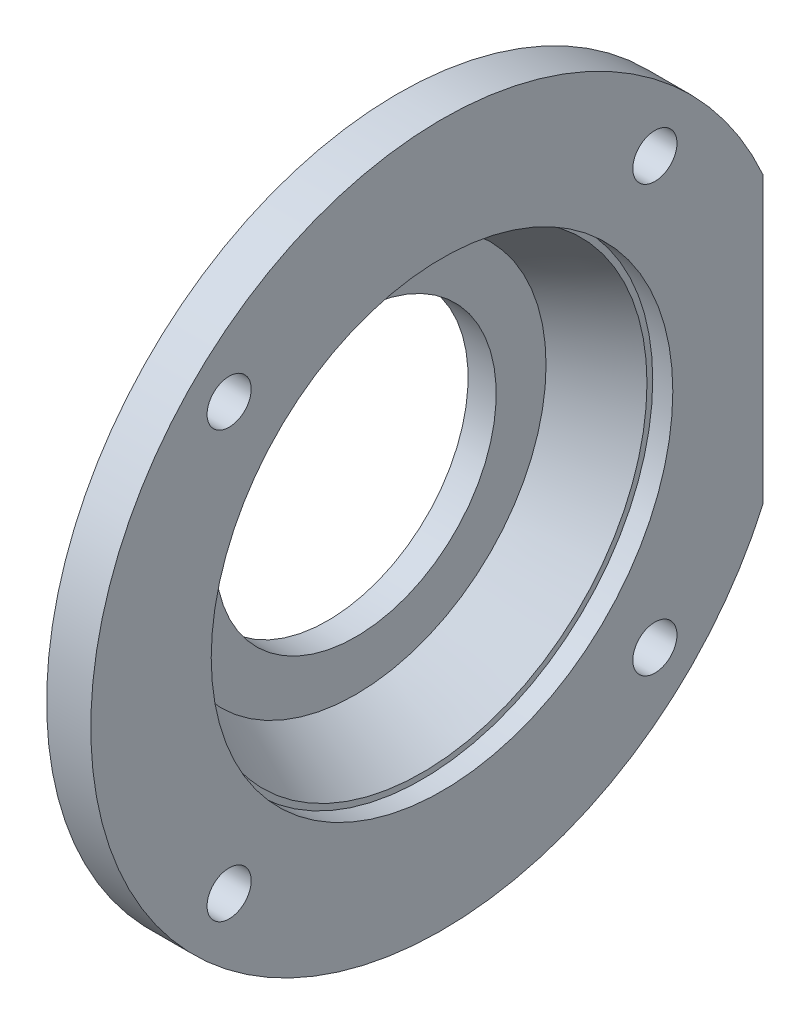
ISO-10303-21;
HEADER;
FILE_DESCRIPTION(('STEP AP214'),'2;1');
FILE_NAME('part.step','',(''),(''),'','','');
FILE_SCHEMA(('AUTOMOTIVE_DESIGN { 1 0 10303 214 1 1 1 1 }'));
ENDSEC;
DATA;
#1=APPLICATION_CONTEXT('core data for automotive mechanical design processes');
#2=APPLICATION_PROTOCOL_DEFINITION('international standard','automotive_design',2000,#1);
#3=PRODUCT_CONTEXT('',#1,'mechanical');
#4=PRODUCT('Part','Part','',(#3));
#5=PRODUCT_RELATED_PRODUCT_CATEGORY('part','',(#4));
#6=PRODUCT_DEFINITION_FORMATION('','',#4);
#7=PRODUCT_DEFINITION_CONTEXT('part definition',#1,'design');
#8=PRODUCT_DEFINITION('design','',#6,#7);
#9=PRODUCT_DEFINITION_SHAPE('','',#8);
#10=(LENGTH_UNIT() NAMED_UNIT(*) SI_UNIT(.MILLI.,.METRE.));
#11=(NAMED_UNIT(*) PLANE_ANGLE_UNIT() SI_UNIT($,.RADIAN.));
#12=(NAMED_UNIT(*) SI_UNIT($,.STERADIAN.) SOLID_ANGLE_UNIT());
#13=UNCERTAINTY_MEASURE_WITH_UNIT(LENGTH_MEASURE(1.E-05),#10,'distance_accuracy_value','');
#14=(GEOMETRIC_REPRESENTATION_CONTEXT(3) GLOBAL_UNCERTAINTY_ASSIGNED_CONTEXT((#13)) GLOBAL_UNIT_ASSIGNED_CONTEXT((#10,
#11,#12)) REPRESENTATION_CONTEXT('',''));
#15=CARTESIAN_POINT('',(0.,0.,0.));
#16=DIRECTION('',(0.,0.,1.));
#17=DIRECTION('',(1.,0.,0.));
#18=AXIS2_PLACEMENT_3D('',#15,#16,#17);
#19=CARTESIAN_POINT('',(57.5,116.13,41.87));
#20=DIRECTION('',(1.,0.,0.));
#21=DIRECTION('',(0.,1.,0.));
#22=AXIS2_PLACEMENT_3D('',#19,#20,#21);
#23=PLANE('',#22);
#24=CARTESIAN_POINT('',(57.5,63.,95.));
#25=DIRECTION('',(-1.,0.,0.));
#26=DIRECTION('',(0.,0.,1.));
#27=AXIS2_PLACEMENT_3D('',#24,#25,#26);
#28=CIRCLE('',#27,52.5);
#29=CARTESIAN_POINT('',(57.4999999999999,63.,147.5));
#30=VERTEX_POINT('',#29);
#31=EDGE_CURVE('E212',#30,#30,#28,.F.);
#32=ORIENTED_EDGE('',*,*,#31,.F.);
#33=EDGE_LOOP('',(#32));
#34=FACE_BOUND('',#33,.T.);
#35=CARTESIAN_POINT('',(57.5,63.,95.));
#36=DIRECTION('',(-1.,0.,0.));
#37=DIRECTION('',(0.,0.,1.));
#38=AXIS2_PLACEMENT_3D('',#35,#36,#37);
#39=CIRCLE('',#38,35.);
#40=CARTESIAN_POINT('',(57.5,63.,130.));
#41=VERTEX_POINT('',#40);
#42=EDGE_CURVE('E20',#41,#41,#39,.F.);
#43=ORIENTED_EDGE('',*,*,#42,.T.);
#44=EDGE_LOOP('',(#43));
#45=FACE_BOUND('',#44,.T.);
#46=ADVANCED_FACE('F16',(#34,#45),#23,.F.);
#47=CARTESIAN_POINT('',(64.5,63.,95.));
#48=DIRECTION('',(-1.,0.,0.));
#49=DIRECTION('',(0.,0.,1.));
#50=AXIS2_PLACEMENT_3D('',#47,#48,#49);
#51=CYLINDRICAL_SURFACE('',#50,35.);
#52=ORIENTED_EDGE('',*,*,#42,.F.);
#53=EDGE_LOOP('',(#52));
#54=FACE_BOUND('',#53,.T.);
#55=CARTESIAN_POINT('',(64.5,63.,95.));
#56=DIRECTION('',(-1.,0.,0.));
#57=DIRECTION('',(0.,0.,1.));
#58=AXIS2_PLACEMENT_3D('',#55,#56,#57);
#59=CIRCLE('',#58,35.);
#60=CARTESIAN_POINT('',(64.4999999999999,63.,130.));
#61=VERTEX_POINT('',#60);
#62=EDGE_CURVE('E209',#61,#61,#59,.F.);
#63=ORIENTED_EDGE('',*,*,#62,.T.);
#64=EDGE_LOOP('',(#63));
#65=FACE_BOUND('',#64,.T.);
#66=ADVANCED_FACE('F221',(#54,#65),#51,.F.);
#67=CARTESIAN_POINT('',(64.5,63.,95.));
#68=DIRECTION('',(-1.,0.,0.));
#69=DIRECTION('',(0.,0.,1.));
#70=AXIS2_PLACEMENT_3D('',#67,#68,#69);
#71=CYLINDRICAL_SURFACE('',#70,52.5);
#72=CARTESIAN_POINT('',(64.5,63.,95.));
#73=DIRECTION('',(1.,0.,0.));
#74=DIRECTION('',(0.,-1.,0.));
#75=AXIS2_PLACEMENT_3D('',#72,#73,#74);
#76=CIRCLE('',#75,52.5);
#77=CARTESIAN_POINT('',(64.5,10.5,95.));
#78=VERTEX_POINT('',#77);
#79=EDGE_CURVE('E208',#78,#78,#76,.T.);
#80=ORIENTED_EDGE('',*,*,#79,.F.);
#81=EDGE_LOOP('',(#80));
#82=FACE_BOUND('',#81,.T.);
#83=ORIENTED_EDGE('',*,*,#31,.T.);
#84=EDGE_LOOP('',(#83));
#85=FACE_BOUND('',#84,.T.);
#86=ADVANCED_FACE('F224',(#82,#85),#71,.T.);
#87=CARTESIAN_POINT('',(64.4999999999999,110.989067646,142.989067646));
#88=DIRECTION('',(-1.,0.,0.));
#89=DIRECTION('',(0.,0.,1.));
#90=AXIS2_PLACEMENT_3D('',#87,#88,#89);
#91=PLANE('',#90);
#92=CARTESIAN_POINT('',(64.4999999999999,63.,95.));
#93=DIRECTION('',(1.,0.,0.));
#94=DIRECTION('',(0.,0.,-1.));
#95=AXIS2_PLACEMENT_3D('',#92,#93,#94);
#96=CIRCLE('',#95,47.420027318);
#97=CARTESIAN_POINT('',(64.5,63.,47.579972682));
#98=VERTEX_POINT('',#97);
#99=EDGE_CURVE('E72',#98,#98,#96,.T.);
#100=ORIENTED_EDGE('',*,*,#99,.T.);
#101=EDGE_LOOP('',(#100));
#102=FACE_BOUND('',#101,.T.);
#103=ORIENTED_EDGE('',*,*,#62,.F.);
#104=EDGE_LOOP('',(#103));
#105=FACE_BOUND('',#104,.T.);
#106=ADVANCED_FACE('F228',(#102,#105),#91,.F.);
#107=CARTESIAN_POINT('',(73.392020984,63.,95.));
#108=DIRECTION('',(1.,0.,0.));
#109=DIRECTION('',(0.,0.,-1.));
#110=AXIS2_PLACEMENT_3D('',#107,#108,#109);
#111=CONICAL_SURFACE('',#110,57.157725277,0.482513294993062);
#112=ORIENTED_EDGE('',*,*,#79,.T.);
#113=EDGE_LOOP('',(#112));
#114=FACE_BOUND('',#113,.T.);
#115=CARTESIAN_POINT('',(73.392020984,63.,95.));
#116=DIRECTION('',(-1.,0.,0.));
#117=DIRECTION('',(0.,0.,1.));
#118=AXIS2_PLACEMENT_3D('',#115,#116,#117);
#119=CIRCLE('',#118,57.157725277);
#120=CARTESIAN_POINT('',(73.3920209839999,63.,152.157725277));
#121=VERTEX_POINT('',#120);
#122=CARTESIAN_POINT('',(73.392020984,63.,37.842274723));
#123=VERTEX_POINT('',#122);
#124=EDGE_CURVE('E67',#121,#123,#119,.T.);
#125=ORIENTED_EDGE('',*,*,#124,.T.);
#126=CARTESIAN_POINT('',(73.392020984,63.,95.));
#127=DIRECTION('',(-1.,0.,0.));
#128=DIRECTION('',(0.,0.,1.));
#129=AXIS2_PLACEMENT_3D('',#126,#127,#128);
#130=CIRCLE('',#129,57.157725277);
#131=EDGE_CURVE('E65',#123,#121,#130,.T.);
#132=ORIENTED_EDGE('',*,*,#131,.T.);
#133=EDGE_LOOP('',(#125,#132));
#134=FACE_BOUND('',#133,.T.);
#135=ADVANCED_FACE('F66',(#114,#134),#111,.T.);
#136=CARTESIAN_POINT('',(80.9999999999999,63.,95.));
#137=DIRECTION('',(1.,0.,0.));
#138=DIRECTION('',(0.,0.,-1.));
#139=AXIS2_PLACEMENT_3D('',#136,#137,#138);
#140=CONICAL_SURFACE('',#139,56.062884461,0.482513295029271);
#141=CARTESIAN_POINT('',(80.9999999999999,63.,95.));
#142=DIRECTION('',(1.,0.,0.));
#143=DIRECTION('',(0.,0.,-1.));
#144=AXIS2_PLACEMENT_3D('',#141,#142,#143);
#145=CIRCLE('',#144,56.062884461);
#146=CARTESIAN_POINT('',(80.9999999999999,63.,38.937115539));
#147=VERTEX_POINT('',#146);
#148=EDGE_CURVE('E83',#147,#147,#145,.T.);
#149=ORIENTED_EDGE('',*,*,#148,.T.);
#150=EDGE_LOOP('',(#149));
#151=FACE_BOUND('',#150,.T.);
#152=ORIENTED_EDGE('',*,*,#99,.F.);
#153=EDGE_LOOP('',(#152));
#154=FACE_BOUND('',#153,.T.);
#155=ADVANCED_FACE('F120',(#151,#154),#140,.F.);
#156=CARTESIAN_POINT('',(75.,63.,35.184780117));
#157=CARTESIAN_POINT('',(75.,-56.6304397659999,35.184780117));
#158=CARTESIAN_POINT('',(74.9999999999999,-56.6304397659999,154.815219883));
#159=CARTESIAN_POINT('',(74.9999999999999,63.,154.815219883));
#160=CARTESIAN_POINT('',(75.,63.,36.330459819));
#161=CARTESIAN_POINT('',(75.,-54.339080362,36.330459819));
#162=CARTESIAN_POINT('',(74.9999999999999,-54.339080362,153.669540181));
#163=CARTESIAN_POINT('',(74.9999999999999,63.,153.669540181));
#164=CARTESIAN_POINT('',(74.406900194,63.,37.310671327));
#165=CARTESIAN_POINT('',(74.406900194,-52.378657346,37.310671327));
#166=CARTESIAN_POINT('',(74.4069001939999,-52.378657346,152.689328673));
#167=CARTESIAN_POINT('',(74.406900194,63.,152.689328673));
#168=CARTESIAN_POINT('',(73.392020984,63.,37.842274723));
#169=CARTESIAN_POINT('',(73.392020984,-51.3154505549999,37.842274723));
#170=CARTESIAN_POINT('',(73.3920209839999,-51.3154505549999,152.157725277));
#171=CARTESIAN_POINT('',(73.3920209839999,63.,152.157725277));
#172=(BOUNDED_SURFACE() B_SPLINE_SURFACE(3,3,((#156,#157,#158,#159),(#160,#161,#162,#163),(#164,
#165,#166,#167),(#168,#169,#170,#171)),.UNSPECIFIED.,.F.,.F.,
.F.) B_SPLINE_SURFACE_WITH_KNOTS((4,4),(4,4),(0.,1.),(0.,1.),
.UNSPECIFIED.) GEOMETRIC_REPRESENTATION_ITEM() RATIONAL_B_SPLINE_SURFACE(((1.,0.333333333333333,
0.333333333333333,1.),(0.90371468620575,0.30123822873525,0.30123822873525,0.90371468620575),
(0.90371468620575,0.30123822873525,0.30123822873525,0.90371468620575),(1.,0.333333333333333,
0.333333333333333,1.))) REPRESENTATION_ITEM('') SURFACE());
#173=CARTESIAN_POINT('',(75.,63.,35.184780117));
#174=CARTESIAN_POINT('',(75.,63.,36.330459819));
#175=CARTESIAN_POINT('',(74.406900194,63.,37.310671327));
#176=CARTESIAN_POINT('',(73.392020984,63.,37.842274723));
#177=(BOUNDED_CURVE() B_SPLINE_CURVE(3,(#173,#174,#175,#176),.UNSPECIFIED.,.F.,
.F.) B_SPLINE_CURVE_WITH_KNOTS((4,4),(0.,1.),
.UNSPECIFIED.) CURVE() GEOMETRIC_REPRESENTATION_ITEM() RATIONAL_B_SPLINE_CURVE((1.,
0.90371468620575,0.90371468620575,1.)) REPRESENTATION_ITEM(''));
#178=CARTESIAN_POINT('',(75.,63.,35.18478010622));
#179=VERTEX_POINT('',#178);
#180=EDGE_CURVE('E75',#123,#179,#177,.F.);
#181=CARTESIAN_POINT('',(75.,63.,35.1847801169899));
#182=CARTESIAN_POINT('',(75.,62.3670885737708,35.1847763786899));
#183=CARTESIAN_POINT('',(75.,61.7341765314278,35.194825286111));
#184=CARTESIAN_POINT('',(75.,60.4489215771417,35.235639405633));
#185=CARTESIAN_POINT('',(75.,59.7965991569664,35.2670516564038));
#186=CARTESIAN_POINT('',(75.,58.4726936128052,35.3525533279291));
#187=CARTESIAN_POINT('',(75.,57.8011547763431,35.4073294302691));
#188=CARTESIAN_POINT('',(75.,56.4391361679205,35.5416234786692));
#189=CARTESIAN_POINT('',(75.,55.7487279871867,35.6218681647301));
#190=CARTESIAN_POINT('',(75.,54.3494618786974,35.8092698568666));
#191=CARTESIAN_POINT('',(75.,53.6407066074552,35.9171938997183));
#192=CARTESIAN_POINT('',(75.,52.2054318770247,36.162220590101));
#193=CARTESIAN_POINT('',(75.,51.4790501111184,36.3001302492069));
#194=CARTESIAN_POINT('',(75.,50.0094265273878,36.6074794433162));
#195=CARTESIAN_POINT('',(75.,49.266361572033,36.7777650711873));
#196=CARTESIAN_POINT('',(75.,47.7645193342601,37.1522870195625));
#197=CARTESIAN_POINT('',(75.,47.0059623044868,37.3574069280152));
#198=CARTESIAN_POINT('',(75.,45.4745526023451,37.8040681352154));
#199=CARTESIAN_POINT('',(75.,44.7019677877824,38.0465281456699));
#200=CARTESIAN_POINT('',(75.,43.1442132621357,38.570365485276));
#201=CARTESIAN_POINT('',(75.,42.3593631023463,38.8526933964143));
#202=CARTESIAN_POINT('',(75.,40.7791067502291,39.4587576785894));
#203=CARTESIAN_POINT('',(75.,39.9840756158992,39.7834722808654));
#204=CARTESIAN_POINT('',(75.,38.3858263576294,40.4767605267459));
#205=CARTESIAN_POINT('',(75.,37.5830421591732,40.8463347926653));
#206=CARTESIAN_POINT('',(74.9999999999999,35.9720149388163,41.6317106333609));
#207=CARTESIAN_POINT('',(75.,35.1642674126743,42.0485288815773));
#208=CARTESIAN_POINT('',(75.,33.5464153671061,42.9306308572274));
#209=CARTESIAN_POINT('',(75.,32.7368697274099,43.3969398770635));
#210=CARTESIAN_POINT('',(75.,31.1189056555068,44.3800778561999));
#211=CARTESIAN_POINT('',(75.,30.3111101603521,44.8979322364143));
#212=CARTESIAN_POINT('',(75.,28.700514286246,45.9859727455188));
#213=CARTESIAN_POINT('',(75.,27.8984001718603,46.5571749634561));
#214=CARTESIAN_POINT('',(75.,26.3034110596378,47.7534169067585));
#215=CARTESIAN_POINT('',(75.,25.5112832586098,48.3794531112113));
#216=CARTESIAN_POINT('',(75.,23.9408687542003,49.6864961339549));
#217=CARTESIAN_POINT('',(75.,23.1633858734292,50.3684689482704));
#218=CARTESIAN_POINT('',(75.,21.627191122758,51.7880776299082));
#219=CARTESIAN_POINT('',(75.,20.869333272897,52.5266378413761));
#220=CARTESIAN_POINT('',(75.,19.3776034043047,54.0596055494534));
#221=CARTESIAN_POINT('',(75.,18.6446269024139,54.8548846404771));
#222=CARTESIAN_POINT('',(75.,17.2081022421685,56.5009027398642));
#223=CARTESIAN_POINT('',(75.,16.5054800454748,57.3524500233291));
#224=CARTESIAN_POINT('',(75.,15.1352643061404,59.1099850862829));
#225=CARTESIAN_POINT('',(75.,14.468613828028,60.0167082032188));
#226=CARTESIAN_POINT('',(75.,13.1760108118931,61.8829051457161));
#227=CARTESIAN_POINT('',(75.,12.5510028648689,62.8430334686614));
#228=CARTESIAN_POINT('',(75.,11.3473423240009,64.8136063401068));
#229=CARTESIAN_POINT('',(75.,10.7696186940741,65.824618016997));
#230=CARTESIAN_POINT('',(75.,9.66600311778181,67.8939066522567));
#231=CARTESIAN_POINT('',(74.9999999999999,9.14100495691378,68.9526617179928));
#232=CARTESIAN_POINT('',(75.,8.39879493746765,70.567951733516));
#233=CARTESIAN_POINT('',(75.,8.1578508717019,71.1137045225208));
#234=CARTESIAN_POINT('',(75.,7.69096387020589,72.2155496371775));
#235=CARTESIAN_POINT('',(75.,7.46512164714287,72.7716847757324));
#236=CARTESIAN_POINT('',(75.,7.02904588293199,73.8936702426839));
#237=CARTESIAN_POINT('',(75.,6.8189081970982,74.4595577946));
#238=CARTESIAN_POINT('',(75.,6.41480244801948,75.6004107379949));
#239=CARTESIAN_POINT('',(74.9999999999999,6.22092468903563,76.1754081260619));
#240=CARTESIAN_POINT('',(74.9999999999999,5.84986964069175,77.3337954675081));
#241=CARTESIAN_POINT('',(75.,5.67277654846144,77.9172123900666));
#242=CARTESIAN_POINT('',(75.,5.33578273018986,79.0917178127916));
#243=CARTESIAN_POINT('',(75.,5.17595953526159,79.6828285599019));
#244=CARTESIAN_POINT('',(75.,4.87395666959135,80.8719648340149));
#245=CARTESIAN_POINT('',(75.,4.73184734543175,81.4700082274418));
#246=CARTESIAN_POINT('',(75.,4.46567920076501,82.6722208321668));
#247=CARTESIAN_POINT('',(75.,4.34168306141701,83.2764039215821));
#248=CARTESIAN_POINT('',(75.,4.11210139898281,84.4900778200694));
#249=CARTESIAN_POINT('',(75.,4.00657045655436,85.0995789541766));
#250=CARTESIAN_POINT('',(75.,3.81422989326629,86.3230452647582));
#251=CARTESIAN_POINT('',(75.,3.72746636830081,86.9370176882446));
#252=CARTESIAN_POINT('',(75.,3.57291974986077,88.1685610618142));
#253=CARTESIAN_POINT('',(75.,3.50517393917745,88.7861366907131));
#254=CARTESIAN_POINT('',(75.,3.38886841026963,90.0240030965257));
#255=CARTESIAN_POINT('',(75.,3.34033689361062,90.6442965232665));
#256=CARTESIAN_POINT('',(75.,3.26261068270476,91.8867014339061));
#257=CARTESIAN_POINT('',(74.9999999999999,3.23343490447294,92.5088141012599));
#258=CARTESIAN_POINT('',(74.9999999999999,3.19451487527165,93.753950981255));
#259=CARTESIAN_POINT('',(74.9999999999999,3.18478011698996,94.3769754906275));
#260=CARTESIAN_POINT('',(74.9999999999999,3.18478011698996,95.6230245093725));
#261=CARTESIAN_POINT('',(74.9999999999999,3.19451487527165,96.246049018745));
#262=CARTESIAN_POINT('',(74.9999999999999,3.23343490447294,97.4911858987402));
#263=CARTESIAN_POINT('',(75.,3.26261068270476,98.1132985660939));
#264=CARTESIAN_POINT('',(75.,3.34033689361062,99.3557034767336));
#265=CARTESIAN_POINT('',(75.,3.38886841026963,99.9759969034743));
#266=CARTESIAN_POINT('',(75.,3.50517393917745,101.213863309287));
#267=CARTESIAN_POINT('',(74.9999999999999,3.57291974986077,101.831438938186));
#268=CARTESIAN_POINT('',(74.9999999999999,3.72746636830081,103.062982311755));
#269=CARTESIAN_POINT('',(74.9999999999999,3.81422989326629,103.676954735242));
#270=CARTESIAN_POINT('',(74.9999999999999,4.00657045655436,104.900421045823));
#271=CARTESIAN_POINT('',(74.9999999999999,4.11210139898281,105.509922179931));
#272=CARTESIAN_POINT('',(74.9999999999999,4.34168306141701,106.723596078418));
#273=CARTESIAN_POINT('',(75.,4.46567920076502,107.327779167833));
#274=CARTESIAN_POINT('',(75.,4.73184734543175,108.529991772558));
#275=CARTESIAN_POINT('',(75.,4.87395666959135,109.128035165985));
#276=CARTESIAN_POINT('',(75.,5.17595953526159,110.317171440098));
#277=CARTESIAN_POINT('',(75.,5.33578273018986,110.908282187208));
#278=CARTESIAN_POINT('',(75.,5.67277654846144,112.082787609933));
#279=CARTESIAN_POINT('',(74.9999999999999,5.84986964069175,112.666204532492));
#280=CARTESIAN_POINT('',(74.9999999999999,6.22092468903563,113.824591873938));
#281=CARTESIAN_POINT('',(74.9999999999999,6.41480244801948,114.399589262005));
#282=CARTESIAN_POINT('',(74.9999999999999,6.8189081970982,115.5404422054));
#283=CARTESIAN_POINT('',(75.,7.02904588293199,116.106329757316));
#284=CARTESIAN_POINT('',(75.,7.46512164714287,117.228315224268));
#285=CARTESIAN_POINT('',(74.9999999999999,7.6909638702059,117.784450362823));
#286=CARTESIAN_POINT('',(74.9999999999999,8.15785087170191,118.886295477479));
#287=CARTESIAN_POINT('',(74.9999999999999,8.39879493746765,119.432048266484));
#288=CARTESIAN_POINT('',(74.9999999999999,9.14100495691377,121.047338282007));
#289=CARTESIAN_POINT('',(74.9999999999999,9.66600311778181,122.106093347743));
#290=CARTESIAN_POINT('',(75.,10.7696186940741,124.175381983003));
#291=CARTESIAN_POINT('',(75.,11.3473423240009,125.186393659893));
#292=CARTESIAN_POINT('',(75.,12.5510028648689,127.156966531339));
#293=CARTESIAN_POINT('',(74.9999999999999,13.1760108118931,128.117094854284));
#294=CARTESIAN_POINT('',(74.9999999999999,14.468613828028,129.983291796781));
#295=CARTESIAN_POINT('',(75.,15.1352643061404,130.890014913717));
#296=CARTESIAN_POINT('',(75.,16.5054800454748,132.647549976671));
#297=CARTESIAN_POINT('',(74.9999999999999,17.2081022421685,133.499097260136));
#298=CARTESIAN_POINT('',(74.9999999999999,18.6446269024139,135.145115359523));
#299=CARTESIAN_POINT('',(74.9999999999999,19.3776034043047,135.940394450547));
#300=CARTESIAN_POINT('',(74.9999999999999,20.869333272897,137.473362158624));
#301=CARTESIAN_POINT('',(75.,21.627191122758,138.211922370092));
#302=CARTESIAN_POINT('',(75.,23.1633858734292,139.63153105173));
#303=CARTESIAN_POINT('',(75.,23.9408687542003,140.313503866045));
#304=CARTESIAN_POINT('',(74.9999999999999,25.5112832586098,141.620546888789));
#305=CARTESIAN_POINT('',(74.9999999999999,26.3034110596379,142.246583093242));
#306=CARTESIAN_POINT('',(74.9999999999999,27.8984001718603,143.442825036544));
#307=CARTESIAN_POINT('',(74.9999999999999,28.700514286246,144.014027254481));
#308=CARTESIAN_POINT('',(74.9999999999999,30.3111101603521,145.102067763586));
#309=CARTESIAN_POINT('',(74.9999999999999,31.1189056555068,145.6199221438));
#310=CARTESIAN_POINT('',(74.9999999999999,32.7368697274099,146.603060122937));
#311=CARTESIAN_POINT('',(75.,33.5464153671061,147.069369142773));
#312=CARTESIAN_POINT('',(74.9999999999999,35.1642674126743,147.951471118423));
#313=CARTESIAN_POINT('',(74.9999999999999,35.9720149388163,148.368289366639));
#314=CARTESIAN_POINT('',(74.9999999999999,37.5830421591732,149.153665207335));
#315=CARTESIAN_POINT('',(74.9999999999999,38.3858263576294,149.523239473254));
#316=CARTESIAN_POINT('',(74.9999999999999,39.9840756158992,150.216527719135));
#317=CARTESIAN_POINT('',(74.9999999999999,40.7791067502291,150.541242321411));
#318=CARTESIAN_POINT('',(74.9999999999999,42.3593631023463,151.147306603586));
#319=CARTESIAN_POINT('',(74.9999999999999,43.1442132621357,151.429634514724));
#320=CARTESIAN_POINT('',(74.9999999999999,44.7019677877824,151.95347185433));
#321=CARTESIAN_POINT('',(74.9999999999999,45.4745526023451,152.195931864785));
#322=CARTESIAN_POINT('',(75.,47.0059623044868,152.642593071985));
#323=CARTESIAN_POINT('',(74.9999999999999,47.7645193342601,152.847712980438));
#324=CARTESIAN_POINT('',(74.9999999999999,49.266361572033,153.222234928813));
#325=CARTESIAN_POINT('',(74.9999999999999,50.0094265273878,153.392520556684));
#326=CARTESIAN_POINT('',(74.9999999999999,51.4790501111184,153.699869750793));
#327=CARTESIAN_POINT('',(74.9999999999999,52.2054318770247,153.837779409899));
#328=CARTESIAN_POINT('',(74.9999999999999,53.6407066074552,154.082806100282));
#329=CARTESIAN_POINT('',(74.9999999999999,54.3494618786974,154.190730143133));
#330=CARTESIAN_POINT('',(74.9999999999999,55.7487279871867,154.37813183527));
#331=CARTESIAN_POINT('',(75.,56.4391361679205,154.458376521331));
#332=CARTESIAN_POINT('',(75.,57.8011547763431,154.592670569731));
#333=CARTESIAN_POINT('',(75.,58.4726936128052,154.647446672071));
#334=CARTESIAN_POINT('',(75.,59.7965991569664,154.732948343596));
#335=CARTESIAN_POINT('',(75.,60.4489215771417,154.764360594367));
#336=CARTESIAN_POINT('',(75.,61.7341765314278,154.805174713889));
#337=CARTESIAN_POINT('',(75.,62.3670885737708,154.81522362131));
#338=CARTESIAN_POINT('',(74.9999999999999,63.,154.81521988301));
#339=B_SPLINE_CURVE_WITH_KNOTS('',3,(#181,#182,#183,#184,#185,#186,#187,#188,#189,#190,#191,
#192,#193,#194,#195,#196,#197,#198,#199,#200,#201,#202,#203,#204,#205,#206,#207,#208,#209,#210,
#211,#212,#213,#214,#215,#216,#217,#218,#219,#220,#221,#222,#223,#224,#225,#226,#227,#228,#229,
#230,#231,#232,#233,#234,#235,#236,#237,#238,#239,#240,#241,#242,#243,#244,#245,#246,#247,#248,
#249,#250,#251,#252,#253,#254,#255,#256,#257,#258,#259,#260,#261,#262,#263,#264,#265,#266,#267,
#268,#269,#270,#271,#272,#273,#274,#275,#276,#277,#278,#279,#280,#281,#282,#283,#284,#285,#286,
#287,#288,#289,#290,#291,#292,#293,#294,#295,#296,#297,#298,#299,#300,#301,#302,#303,#304,#305,
#306,#307,#308,#309,#310,#311,#312,#313,#314,#315,#316,#317,#318,#319,#320,#321,#322,#323,#324,
#325,#326,#327,#328,#329,#330,#331,#332,#333,#334,#335,#336,#337,#338),.UNSPECIFIED.,.F.,.F.,(4,
2,2,2,2,2,2,2,2,2,2,2,2,2,2,2,2,2,2,2,2,2,2,2,2,2,2,2,2,2,2,2,2,2,2,2,2,2,2,2,2,2,2,2,2,2,2,2,2,
2,2,2,2,2,2,2,2,2,2,2,2,2,2,2,2,2,2,2,2,2,2,2,2,2,2,2,2,2,4),(0.,1.89865669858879,
3.85754146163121,5.87846427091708,7.96320977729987,10.1135219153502,12.331086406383,
14.6175110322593,16.9743035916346,19.402847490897,21.9043749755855,24.4799380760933,
27.1303774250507,29.8562892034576,32.6579905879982,35.5354842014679,38.488422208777,
41.5160708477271,44.617276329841,47.7904331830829,51.0334562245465,54.3437574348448,
57.7182290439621,61.1532341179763,64.6446058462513,68.1876565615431,69.9771590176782,
71.7776013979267,73.5882615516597,75.4083903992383,77.2372134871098,79.0739327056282,
80.9177281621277,82.767760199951,84.6231715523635,86.4830896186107,88.3466288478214,
90.2128932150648,92.0809787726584,93.9499762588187,95.818973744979,97.6870593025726,
99.553323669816,101.416862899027,103.276780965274,105.132192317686,106.98222435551,
108.826019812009,110.662739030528,112.491562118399,114.311690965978,116.122351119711,
117.922793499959,119.712295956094,123.255346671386,126.746718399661,130.181723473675,
133.556195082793,136.866496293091,140.109519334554,143.282676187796,146.38388166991,
149.41153030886,152.364468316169,155.241961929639,158.04366331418,160.769575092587,
163.420014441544,165.995577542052,168.49710502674,170.925648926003,173.282441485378,
175.568866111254,177.786430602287,179.936742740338,182.02148824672,184.042411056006,
186.001295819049,187.899952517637),.UNSPECIFIED.);
#340=CARTESIAN_POINT('',(75.,63.,154.815219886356));
#341=VERTEX_POINT('',#340);
#342=EDGE_CURVE('E80',#179,#341,#339,.T.);
#343=CARTESIAN_POINT('',(74.9999999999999,63.,154.815219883));
#344=CARTESIAN_POINT('',(74.9999999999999,63.,153.669540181));
#345=CARTESIAN_POINT('',(74.406900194,63.,152.689328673));
#346=CARTESIAN_POINT('',(73.3920209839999,63.,152.157725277));
#347=(BOUNDED_CURVE() B_SPLINE_CURVE(3,(#343,#344,#345,#346),.UNSPECIFIED.,.F.,
.F.) B_SPLINE_CURVE_WITH_KNOTS((4,4),(0.,1.),
.UNSPECIFIED.) CURVE() GEOMETRIC_REPRESENTATION_ITEM() RATIONAL_B_SPLINE_CURVE((1.,
0.90371468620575,0.90371468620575,1.)) REPRESENTATION_ITEM(''));
#348=EDGE_CURVE('E54',#341,#121,#347,.T.);
#349=ORIENTED_EDGE('',*,*,#180,.T.);
#350=ORIENTED_EDGE('',*,*,#342,.T.);
#351=ORIENTED_EDGE('',*,*,#348,.T.);
#352=ORIENTED_EDGE('',*,*,#131,.F.);
#353=EDGE_LOOP('',(#349,#350,#351,#352));
#354=FACE_BOUND('',#353,.T.);
#355=ADVANCED_FACE('F79',(#354),#172,.F.);
#356=CARTESIAN_POINT('',(74.9999999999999,63.,154.815219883));
#357=CARTESIAN_POINT('',(74.9999999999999,182.630439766,154.815219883));
#358=CARTESIAN_POINT('',(75.,182.630439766,35.184780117));
#359=CARTESIAN_POINT('',(75.,63.,35.184780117));
#360=CARTESIAN_POINT('',(74.9999999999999,63.,153.669540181));
#361=CARTESIAN_POINT('',(74.9999999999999,180.339080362,153.669540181));
#362=CARTESIAN_POINT('',(75.,180.339080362,36.330459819));
#363=CARTESIAN_POINT('',(75.,63.,36.330459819));
#364=CARTESIAN_POINT('',(74.406900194,63.,152.689328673));
#365=CARTESIAN_POINT('',(74.406900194,178.378657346,152.689328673));
#366=CARTESIAN_POINT('',(74.406900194,178.378657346,37.310671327));
#367=CARTESIAN_POINT('',(74.406900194,63.,37.310671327));
#368=CARTESIAN_POINT('',(73.3920209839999,63.,152.157725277));
#369=CARTESIAN_POINT('',(73.3920209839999,177.315450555,152.157725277));
#370=CARTESIAN_POINT('',(73.392020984,177.315450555,37.842274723));
#371=CARTESIAN_POINT('',(73.392020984,63.,37.842274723));
#372=(BOUNDED_SURFACE() B_SPLINE_SURFACE(3,3,((#356,#357,#358,#359),(#360,#361,#362,#363),(#364,
#365,#366,#367),(#368,#369,#370,#371)),.UNSPECIFIED.,.F.,.F.,
.F.) B_SPLINE_SURFACE_WITH_KNOTS((4,4),(4,4),(0.,1.),(0.,1.),
.UNSPECIFIED.) GEOMETRIC_REPRESENTATION_ITEM() RATIONAL_B_SPLINE_SURFACE(((1.,0.333333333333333,
0.333333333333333,1.),(0.90371468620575,0.30123822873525,0.30123822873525,0.90371468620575),
(0.90371468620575,0.30123822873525,0.30123822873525,0.90371468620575),(1.,0.333333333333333,
0.333333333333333,1.))) REPRESENTATION_ITEM('') SURFACE());
#373=CARTESIAN_POINT('',(74.9999999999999,63.,154.81521988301));
#374=CARTESIAN_POINT('',(75.,63.6329114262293,154.81522362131));
#375=CARTESIAN_POINT('',(75.,64.2658234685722,154.805174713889));
#376=CARTESIAN_POINT('',(75.,65.5510784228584,154.764360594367));
#377=CARTESIAN_POINT('',(75.,66.2034008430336,154.732948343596));
#378=CARTESIAN_POINT('',(75.,67.5273063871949,154.647446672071));
#379=CARTESIAN_POINT('',(75.,68.198845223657,154.592670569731));
#380=CARTESIAN_POINT('',(75.,69.5608638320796,154.458376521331));
#381=CARTESIAN_POINT('',(74.9999999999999,70.2512720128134,154.37813183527));
#382=CARTESIAN_POINT('',(74.9999999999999,71.6505381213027,154.190730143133));
#383=CARTESIAN_POINT('',(74.9999999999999,72.3592933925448,154.082806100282));
#384=CARTESIAN_POINT('',(74.9999999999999,73.7945681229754,153.837779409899));
#385=CARTESIAN_POINT('',(74.9999999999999,74.5209498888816,153.699869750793));
#386=CARTESIAN_POINT('',(74.9999999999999,75.9905734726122,153.392520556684));
#387=CARTESIAN_POINT('',(74.9999999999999,76.7336384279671,153.222234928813));
#388=CARTESIAN_POINT('',(74.9999999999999,78.2354806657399,152.847712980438));
#389=CARTESIAN_POINT('',(74.9999999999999,78.9940376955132,152.642593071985));
#390=CARTESIAN_POINT('',(74.9999999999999,80.5254473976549,152.195931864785));
#391=CARTESIAN_POINT('',(74.9999999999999,81.2980322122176,151.95347185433));
#392=CARTESIAN_POINT('',(74.9999999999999,82.8557867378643,151.429634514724));
#393=CARTESIAN_POINT('',(74.9999999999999,83.6406368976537,151.147306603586));
#394=CARTESIAN_POINT('',(75.,85.220893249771,150.541242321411));
#395=CARTESIAN_POINT('',(75.,86.0159243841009,150.216527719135));
#396=CARTESIAN_POINT('',(74.9999999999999,87.6141736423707,149.523239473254));
#397=CARTESIAN_POINT('',(74.9999999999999,88.4169578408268,149.153665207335));
#398=CARTESIAN_POINT('',(74.9999999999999,90.0279850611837,148.368289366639));
#399=CARTESIAN_POINT('',(75.,90.8357325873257,147.951471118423));
#400=CARTESIAN_POINT('',(75.,92.453584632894,147.069369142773));
#401=CARTESIAN_POINT('',(75.,93.2631302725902,146.603060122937));
#402=CARTESIAN_POINT('',(75.,94.8810943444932,145.6199221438));
#403=CARTESIAN_POINT('',(75.,95.688889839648,145.102067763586));
#404=CARTESIAN_POINT('',(75.,97.2994857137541,144.014027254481));
#405=CARTESIAN_POINT('',(75.,98.1015998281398,143.442825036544));
#406=CARTESIAN_POINT('',(74.9999999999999,99.6965889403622,142.246583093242));
#407=CARTESIAN_POINT('',(74.9999999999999,100.48871674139,141.620546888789));
#408=CARTESIAN_POINT('',(74.9999999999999,102.0591312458,140.313503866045));
#409=CARTESIAN_POINT('',(75.,102.836614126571,139.63153105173));
#410=CARTESIAN_POINT('',(75.,104.372808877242,138.211922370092));
#411=CARTESIAN_POINT('',(74.9999999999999,105.130666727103,137.473362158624));
#412=CARTESIAN_POINT('',(74.9999999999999,106.622396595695,135.940394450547));
#413=CARTESIAN_POINT('',(75.,107.355373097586,135.145115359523));
#414=CARTESIAN_POINT('',(75.,108.791897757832,133.499097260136));
#415=CARTESIAN_POINT('',(75.,109.494519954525,132.647549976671));
#416=CARTESIAN_POINT('',(75.,110.86473569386,130.890014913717));
#417=CARTESIAN_POINT('',(75.,111.531386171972,129.983291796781));
#418=CARTESIAN_POINT('',(75.,112.823989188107,128.117094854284));
#419=CARTESIAN_POINT('',(75.,113.448997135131,127.156966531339));
#420=CARTESIAN_POINT('',(75.,114.652657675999,125.186393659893));
#421=CARTESIAN_POINT('',(75.,115.230381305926,124.175381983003));
#422=CARTESIAN_POINT('',(75.,116.333996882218,122.106093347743));
#423=CARTESIAN_POINT('',(74.9999999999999,116.858995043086,121.047338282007));
#424=CARTESIAN_POINT('',(75.,117.601205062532,119.432048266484));
#425=CARTESIAN_POINT('',(75.,117.842149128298,118.886295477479));
#426=CARTESIAN_POINT('',(75.,118.309036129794,117.784450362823));
#427=CARTESIAN_POINT('',(75.,118.534878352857,117.228315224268));
#428=CARTESIAN_POINT('',(75.,118.970954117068,116.106329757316));
#429=CARTESIAN_POINT('',(75.,119.181091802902,115.5404422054));
#430=CARTESIAN_POINT('',(75.,119.585197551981,114.399589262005));
#431=CARTESIAN_POINT('',(75.,119.779075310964,113.824591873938));
#432=CARTESIAN_POINT('',(75.,120.150130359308,112.666204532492));
#433=CARTESIAN_POINT('',(75.,120.327223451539,112.082787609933));
#434=CARTESIAN_POINT('',(75.,120.66421726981,110.908282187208));
#435=CARTESIAN_POINT('',(75.,120.824040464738,110.317171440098));
#436=CARTESIAN_POINT('',(75.,121.126043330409,109.128035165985));
#437=CARTESIAN_POINT('',(75.,121.268152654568,108.529991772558));
#438=CARTESIAN_POINT('',(75.,121.534320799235,107.327779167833));
#439=CARTESIAN_POINT('',(75.,121.658316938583,106.723596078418));
#440=CARTESIAN_POINT('',(75.,121.887898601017,105.509922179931));
#441=CARTESIAN_POINT('',(75.,121.993429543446,104.900421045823));
#442=CARTESIAN_POINT('',(75.,122.185770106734,103.676954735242));
#443=CARTESIAN_POINT('',(75.,122.272533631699,103.062982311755));
#444=CARTESIAN_POINT('',(75.,122.427080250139,101.831438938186));
#445=CARTESIAN_POINT('',(75.,122.494826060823,101.213863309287));
#446=CARTESIAN_POINT('',(75.,122.61113158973,99.9759969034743));
#447=CARTESIAN_POINT('',(75.,122.659663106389,99.3557034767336));
#448=CARTESIAN_POINT('',(75.,122.737389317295,98.1132985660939));
#449=CARTESIAN_POINT('',(75.,122.766565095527,97.4911858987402));
#450=CARTESIAN_POINT('',(75.,122.805485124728,96.246049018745));
#451=CARTESIAN_POINT('',(75.,122.81521988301,95.6230245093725));
#452=CARTESIAN_POINT('',(75.,122.81521988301,94.3769754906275));
#453=CARTESIAN_POINT('',(75.,122.805485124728,93.753950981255));
#454=CARTESIAN_POINT('',(75.,122.766565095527,92.5088141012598));
#455=CARTESIAN_POINT('',(75.,122.737389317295,91.8867014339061));
#456=CARTESIAN_POINT('',(75.,122.659663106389,90.6442965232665));
#457=CARTESIAN_POINT('',(75.,122.61113158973,90.0240030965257));
#458=CARTESIAN_POINT('',(75.,122.494826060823,88.7861366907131));
#459=CARTESIAN_POINT('',(75.,122.427080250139,88.1685610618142));
#460=CARTESIAN_POINT('',(75.,122.272533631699,86.9370176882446));
#461=CARTESIAN_POINT('',(75.,122.185770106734,86.3230452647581));
#462=CARTESIAN_POINT('',(75.,121.993429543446,85.0995789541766));
#463=CARTESIAN_POINT('',(75.,121.887898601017,84.4900778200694));
#464=CARTESIAN_POINT('',(75.,121.658316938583,83.2764039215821));
#465=CARTESIAN_POINT('',(75.,121.534320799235,82.6722208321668));
#466=CARTESIAN_POINT('',(75.,121.268152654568,81.4700082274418));
#467=CARTESIAN_POINT('',(75.,121.126043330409,80.8719648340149));
#468=CARTESIAN_POINT('',(75.,120.824040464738,79.6828285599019));
#469=CARTESIAN_POINT('',(75.,120.66421726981,79.0917178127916));
#470=CARTESIAN_POINT('',(75.,120.327223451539,77.9172123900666));
#471=CARTESIAN_POINT('',(75.,120.150130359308,77.3337954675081));
#472=CARTESIAN_POINT('',(75.,119.779075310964,76.1754081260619));
#473=CARTESIAN_POINT('',(75.,119.585197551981,75.6004107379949));
#474=CARTESIAN_POINT('',(75.,119.181091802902,74.4595577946));
#475=CARTESIAN_POINT('',(75.,118.970954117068,73.8936702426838));
#476=CARTESIAN_POINT('',(75.,118.534878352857,72.7716847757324));
#477=CARTESIAN_POINT('',(75.,118.309036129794,72.2155496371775));
#478=CARTESIAN_POINT('',(75.,117.842149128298,71.1137045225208));
#479=CARTESIAN_POINT('',(75.,117.601205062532,70.567951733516));
#480=CARTESIAN_POINT('',(75.,116.858995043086,68.9526617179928));
#481=CARTESIAN_POINT('',(75.,116.333996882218,67.8939066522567));
#482=CARTESIAN_POINT('',(75.,115.230381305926,65.824618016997));
#483=CARTESIAN_POINT('',(75.,114.652657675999,64.8136063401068));
#484=CARTESIAN_POINT('',(75.,113.448997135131,62.8430334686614));
#485=CARTESIAN_POINT('',(75.,112.823989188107,61.8829051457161));
#486=CARTESIAN_POINT('',(75.,111.531386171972,60.0167082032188));
#487=CARTESIAN_POINT('',(75.,110.86473569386,59.1099850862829));
#488=CARTESIAN_POINT('',(75.,109.494519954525,57.3524500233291));
#489=CARTESIAN_POINT('',(75.,108.791897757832,56.5009027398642));
#490=CARTESIAN_POINT('',(75.,107.355373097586,54.8548846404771));
#491=CARTESIAN_POINT('',(75.,106.622396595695,54.0596055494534));
#492=CARTESIAN_POINT('',(75.,105.130666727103,52.5266378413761));
#493=CARTESIAN_POINT('',(75.,104.372808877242,51.7880776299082));
#494=CARTESIAN_POINT('',(75.,102.836614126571,50.3684689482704));
#495=CARTESIAN_POINT('',(75.,102.0591312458,49.6864961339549));
#496=CARTESIAN_POINT('',(75.,100.48871674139,48.3794531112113));
#497=CARTESIAN_POINT('',(75.,99.6965889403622,47.7534169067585));
#498=CARTESIAN_POINT('',(75.,98.1015998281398,46.5571749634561));
#499=CARTESIAN_POINT('',(75.,97.2994857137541,45.9859727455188));
#500=CARTESIAN_POINT('',(75.,95.688889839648,44.8979322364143));
#501=CARTESIAN_POINT('',(75.,94.8810943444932,44.3800778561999));
#502=CARTESIAN_POINT('',(75.,93.2631302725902,43.3969398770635));
#503=CARTESIAN_POINT('',(75.,92.453584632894,42.9306308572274));
#504=CARTESIAN_POINT('',(75.,90.8357325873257,42.0485288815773));
#505=CARTESIAN_POINT('',(75.,90.0279850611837,41.6317106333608));
#506=CARTESIAN_POINT('',(75.,88.4169578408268,40.8463347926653));
#507=CARTESIAN_POINT('',(75.,87.6141736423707,40.4767605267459));
#508=CARTESIAN_POINT('',(75.,86.0159243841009,39.7834722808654));
#509=CARTESIAN_POINT('',(75.,85.220893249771,39.4587576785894));
#510=CARTESIAN_POINT('',(75.,83.6406368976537,38.8526933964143));
#511=CARTESIAN_POINT('',(75.,82.8557867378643,38.570365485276));
#512=CARTESIAN_POINT('',(75.,81.2980322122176,38.0465281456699));
#513=CARTESIAN_POINT('',(75.,80.5254473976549,37.8040681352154));
#514=CARTESIAN_POINT('',(75.,78.9940376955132,37.3574069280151));
#515=CARTESIAN_POINT('',(75.,78.2354806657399,37.1522870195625));
#516=CARTESIAN_POINT('',(75.,76.7336384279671,36.7777650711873));
#517=CARTESIAN_POINT('',(75.,75.9905734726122,36.6074794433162));
#518=CARTESIAN_POINT('',(75.,74.5209498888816,36.3001302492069));
#519=CARTESIAN_POINT('',(75.,73.7945681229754,36.162220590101));
#520=CARTESIAN_POINT('',(75.,72.3592933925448,35.9171938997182));
#521=CARTESIAN_POINT('',(75.,71.6505381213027,35.8092698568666));
#522=CARTESIAN_POINT('',(75.,70.2512720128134,35.6218681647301));
#523=CARTESIAN_POINT('',(75.,69.5608638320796,35.5416234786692));
#524=CARTESIAN_POINT('',(75.,68.198845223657,35.407329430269));
#525=CARTESIAN_POINT('',(75.,67.5273063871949,35.3525533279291));
#526=CARTESIAN_POINT('',(75.,66.2034008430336,35.2670516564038));
#527=CARTESIAN_POINT('',(75.,65.5510784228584,35.235639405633));
#528=CARTESIAN_POINT('',(75.,64.2658234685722,35.194825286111));
#529=CARTESIAN_POINT('',(75.,63.6329114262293,35.1847763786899));
#530=CARTESIAN_POINT('',(75.,63.,35.1847801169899));
#531=B_SPLINE_CURVE_WITH_KNOTS('',3,(#373,#374,#375,#376,#377,#378,#379,#380,#381,#382,#383,
#384,#385,#386,#387,#388,#389,#390,#391,#392,#393,#394,#395,#396,#397,#398,#399,#400,#401,#402,
#403,#404,#405,#406,#407,#408,#409,#410,#411,#412,#413,#414,#415,#416,#417,#418,#419,#420,#421,
#422,#423,#424,#425,#426,#427,#428,#429,#430,#431,#432,#433,#434,#435,#436,#437,#438,#439,#440,
#441,#442,#443,#444,#445,#446,#447,#448,#449,#450,#451,#452,#453,#454,#455,#456,#457,#458,#459,
#460,#461,#462,#463,#464,#465,#466,#467,#468,#469,#470,#471,#472,#473,#474,#475,#476,#477,#478,
#479,#480,#481,#482,#483,#484,#485,#486,#487,#488,#489,#490,#491,#492,#493,#494,#495,#496,#497,
#498,#499,#500,#501,#502,#503,#504,#505,#506,#507,#508,#509,#510,#511,#512,#513,#514,#515,#516,
#517,#518,#519,#520,#521,#522,#523,#524,#525,#526,#527,#528,#529,#530),.UNSPECIFIED.,.F.,.F.,(4,
2,2,2,2,2,2,2,2,2,2,2,2,2,2,2,2,2,2,2,2,2,2,2,2,2,2,2,2,2,2,2,2,2,2,2,2,2,2,2,2,2,2,2,2,2,2,2,2,
2,2,2,2,2,2,2,2,2,2,2,2,2,2,2,2,2,2,2,2,2,2,2,2,2,2,2,2,2,4),(0.,1.89865669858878,
3.85754146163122,5.87846427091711,7.96320977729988,10.1135219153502,12.331086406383,
14.6175110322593,16.9743035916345,19.402847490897,21.9043749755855,24.4799380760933,
27.1303774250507,29.8562892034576,32.6579905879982,35.5354842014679,38.488422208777,
41.5160708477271,44.617276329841,47.790433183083,51.0334562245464,54.3437574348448,
57.7182290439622,61.1532341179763,64.6446058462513,68.1876565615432,69.9771590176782,
71.7776013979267,73.5882615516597,75.4083903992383,77.2372134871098,79.0739327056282,
80.9177281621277,82.767760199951,84.6231715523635,86.4830896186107,88.3466288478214,
90.2128932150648,92.0809787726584,93.9499762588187,95.818973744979,97.6870593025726,
99.5533236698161,101.416862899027,103.276780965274,105.132192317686,106.98222435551,
108.826019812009,110.662739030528,112.491562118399,114.311690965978,116.122351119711,
117.922793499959,119.712295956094,123.255346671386,126.746718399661,130.181723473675,
133.556195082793,136.866496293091,140.109519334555,143.282676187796,146.38388166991,
149.41153030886,152.364468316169,155.241961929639,158.04366331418,160.769575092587,
163.420014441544,165.995577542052,168.49710502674,170.925648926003,173.282441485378,
175.568866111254,177.786430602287,179.936742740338,182.02148824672,184.042411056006,
186.001295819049,187.899952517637),.UNSPECIFIED.);
#532=EDGE_CURVE('E149',#341,#179,#531,.T.);
#533=ORIENTED_EDGE('',*,*,#532,.T.);
#534=ORIENTED_EDGE('',*,*,#180,.F.);
#535=ORIENTED_EDGE('',*,*,#124,.F.);
#536=ORIENTED_EDGE('',*,*,#348,.F.);
#537=EDGE_LOOP('',(#533,#534,#535,#536));
#538=FACE_BOUND('',#537,.T.);
#539=ADVANCED_FACE('F74',(#538),#372,.F.);
#540=CARTESIAN_POINT('',(80.9999999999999,121.19,153.19));
#541=DIRECTION('',(-1.,0.,0.));
#542=DIRECTION('',(0.,0.,1.));
#543=AXIS2_PLACEMENT_3D('',#540,#541,#542);
#544=PLANE('',#543);
#545=CARTESIAN_POINT('',(81.,63.,95.));
#546=DIRECTION('',(-1.,0.,0.));
#547=DIRECTION('',(0.,0.,1.));
#548=AXIS2_PLACEMENT_3D('',#545,#546,#547);
#549=CIRCLE('',#548,57.5);
#550=CARTESIAN_POINT('',(80.9999999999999,63.,152.5));
#551=VERTEX_POINT('',#550);
#552=EDGE_CURVE('E189',#551,#551,#549,.F.);
#553=ORIENTED_EDGE('',*,*,#552,.T.);
#554=EDGE_LOOP('',(#553));
#555=FACE_BOUND('',#554,.T.);
#556=ORIENTED_EDGE('',*,*,#148,.F.);
#557=EDGE_LOOP('',(#556));
#558=FACE_BOUND('',#557,.T.);
#559=ADVANCED_FACE('F132',(#555,#558),#544,.F.);
#560=CARTESIAN_POINT('',(75.,151.55,15.));
#561=DIRECTION('',(1.,0.,0.));
#562=DIRECTION('',(0.,1.,0.));
#563=AXIS2_PLACEMENT_3D('',#560,#561,#562);
#564=PLANE('',#563);
#565=CARTESIAN_POINT('',(75.,63.,95.));
#566=DIRECTION('',(-1.,0.,0.));
#567=DIRECTION('',(0.,0.,1.));
#568=AXIS2_PLACEMENT_3D('',#565,#566,#567);
#569=CIRCLE('',#568,87.5);
#570=CARTESIAN_POINT('',(75.,98.4436171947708,15.));
#571=VERTEX_POINT('',#570);
#572=CARTESIAN_POINT('',(75.,27.556382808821,15.));
#573=VERTEX_POINT('',#572);
#574=EDGE_CURVE('E153',#571,#573,#569,.F.);
#575=ORIENTED_EDGE('',*,*,#574,.F.);
#576=DIRECTION('',(0.,-1.,0.));
#577=VECTOR('',#576,1.);
#578=CARTESIAN_POINT('',(75.,98.443617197,15.));
#579=LINE('',#578,#577);
#580=EDGE_CURVE('E44',#571,#573,#579,.T.);
#581=ORIENTED_EDGE('',*,*,#580,.T.);
#582=EDGE_LOOP('',(#575,#581));
#583=FACE_BOUND('',#582,.T.);
#584=CARTESIAN_POINT('',(75.,116.033008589,41.966991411));
#585=DIRECTION('',(1.,0.,0.));
#586=DIRECTION('',(0.,0.,-1.));
#587=AXIS2_PLACEMENT_3D('',#584,#585,#586);
#588=CIRCLE('',#587,5.50000000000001);
#589=CARTESIAN_POINT('',(75.,116.033008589,36.466991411));
#590=VERTEX_POINT('',#589);
#591=EDGE_CURVE('E272',#590,#590,#588,.T.);
#592=ORIENTED_EDGE('',*,*,#591,.T.);
#593=EDGE_LOOP('',(#592));
#594=FACE_BOUND('',#593,.T.);
#595=CARTESIAN_POINT('',(74.9999999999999,116.033008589,148.033008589));
#596=DIRECTION('',(1.,0.,0.));
#597=DIRECTION('',(0.,0.,-1.));
#598=AXIS2_PLACEMENT_3D('',#595,#596,#597);
#599=CIRCLE('',#598,5.5);
#600=CARTESIAN_POINT('',(74.9999999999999,116.033008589,142.533008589));
#601=VERTEX_POINT('',#600);
#602=EDGE_CURVE('E276',#601,#601,#599,.T.);
#603=ORIENTED_EDGE('',*,*,#602,.T.);
#604=EDGE_LOOP('',(#603));
#605=FACE_BOUND('',#604,.T.);
#606=CARTESIAN_POINT('',(75.,9.96699141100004,41.966991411));
#607=DIRECTION('',(1.,0.,0.));
#608=DIRECTION('',(0.,0.,-1.));
#609=AXIS2_PLACEMENT_3D('',#606,#607,#608);
#610=CIRCLE('',#609,5.50000000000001);
#611=CARTESIAN_POINT('',(75.,9.96699141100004,36.466991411));
#612=VERTEX_POINT('',#611);
#613=EDGE_CURVE('E201',#612,#612,#610,.T.);
#614=ORIENTED_EDGE('',*,*,#613,.T.);
#615=EDGE_LOOP('',(#614));
#616=FACE_BOUND('',#615,.T.);
#617=CARTESIAN_POINT('',(74.9999999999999,9.96699141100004,148.033008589));
#618=DIRECTION('',(1.,0.,0.));
#619=DIRECTION('',(0.,0.,-1.));
#620=AXIS2_PLACEMENT_3D('',#617,#618,#619);
#621=CIRCLE('',#620,5.5);
#622=CARTESIAN_POINT('',(74.9999999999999,9.96699141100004,142.533008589));
#623=VERTEX_POINT('',#622);
#624=EDGE_CURVE('E194',#623,#623,#621,.T.);
#625=ORIENTED_EDGE('',*,*,#624,.T.);
#626=EDGE_LOOP('',(#625));
#627=FACE_BOUND('',#626,.T.);
#628=ORIENTED_EDGE('',*,*,#342,.F.);
#629=ORIENTED_EDGE('',*,*,#532,.F.);
#630=EDGE_LOOP('',(#628,#629));
#631=FACE_BOUND('',#630,.T.);
#632=ADVANCED_FACE('F164',(#583,#594,#605,#616,#627,#631),#564,.F.);
#633=CARTESIAN_POINT('',(86.,63.,95.));
#634=DIRECTION('',(-1.,0.,0.));
#635=DIRECTION('',(0.,0.,1.));
#636=AXIS2_PLACEMENT_3D('',#633,#634,#635);
#637=CYLINDRICAL_SURFACE('',#636,57.5);
#638=ORIENTED_EDGE('',*,*,#552,.F.);
#639=EDGE_LOOP('',(#638));
#640=FACE_BOUND('',#639,.T.);
#641=CARTESIAN_POINT('',(86.,63.,95.));
#642=DIRECTION('',(-1.,0.,0.));
#643=DIRECTION('',(0.,0.,1.));
#644=AXIS2_PLACEMENT_3D('',#641,#642,#643);
#645=CIRCLE('',#644,57.5);
#646=CARTESIAN_POINT('',(86.,63.,152.5));
#647=VERTEX_POINT('',#646);
#648=EDGE_CURVE('E158',#647,#647,#645,.F.);
#649=ORIENTED_EDGE('',*,*,#648,.T.);
#650=EDGE_LOOP('',(#649));
#651=FACE_BOUND('',#650,.T.);
#652=ADVANCED_FACE('F173',(#640,#651),#637,.F.);
#653=CARTESIAN_POINT('',(74.9999999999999,9.96699141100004,148.033008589));
#654=DIRECTION('',(1.,0.,0.));
#655=DIRECTION('',(0.,0.,-1.));
#656=AXIS2_PLACEMENT_3D('',#653,#654,#655);
#657=CYLINDRICAL_SURFACE('',#656,5.5);
#658=ORIENTED_EDGE('',*,*,#624,.F.);
#659=EDGE_LOOP('',(#658));
#660=FACE_BOUND('',#659,.T.);
#661=CARTESIAN_POINT('',(85.9999999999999,9.96699141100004,148.033008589));
#662=DIRECTION('',(1.,0.,0.));
#663=DIRECTION('',(0.,0.,-1.));
#664=AXIS2_PLACEMENT_3D('',#661,#662,#663);
#665=CIRCLE('',#664,5.5);
#666=CARTESIAN_POINT('',(85.9999999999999,9.96699141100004,142.533008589));
#667=VERTEX_POINT('',#666);
#668=EDGE_CURVE('E262',#667,#667,#665,.T.);
#669=ORIENTED_EDGE('',*,*,#668,.T.);
#670=EDGE_LOOP('',(#669));
#671=FACE_BOUND('',#670,.T.);
#672=ADVANCED_FACE('F289',(#660,#671),#657,.F.);
#673=CARTESIAN_POINT('',(75.,9.96699141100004,41.966991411));
#674=DIRECTION('',(1.,0.,0.));
#675=DIRECTION('',(0.,0.,-1.));
#676=AXIS2_PLACEMENT_3D('',#673,#674,#675);
#677=CYLINDRICAL_SURFACE('',#676,5.50000000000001);
#678=ORIENTED_EDGE('',*,*,#613,.F.);
#679=EDGE_LOOP('',(#678));
#680=FACE_BOUND('',#679,.T.);
#681=CARTESIAN_POINT('',(86.,9.96699141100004,41.966991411));
#682=DIRECTION('',(1.,0.,0.));
#683=DIRECTION('',(0.,0.,-1.));
#684=AXIS2_PLACEMENT_3D('',#681,#682,#683);
#685=CIRCLE('',#684,5.50000000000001);
#686=CARTESIAN_POINT('',(86.,9.96699141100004,36.466991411));
#687=VERTEX_POINT('',#686);
#688=EDGE_CURVE('E258',#687,#687,#685,.T.);
#689=ORIENTED_EDGE('',*,*,#688,.T.);
#690=EDGE_LOOP('',(#689));
#691=FACE_BOUND('',#690,.T.);
#692=ADVANCED_FACE('F285',(#680,#691),#677,.F.);
#693=CARTESIAN_POINT('',(74.9999999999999,116.033008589,148.033008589));
#694=DIRECTION('',(1.,0.,0.));
#695=DIRECTION('',(0.,0.,-1.));
#696=AXIS2_PLACEMENT_3D('',#693,#694,#695);
#697=CYLINDRICAL_SURFACE('',#696,5.5);
#698=ORIENTED_EDGE('',*,*,#602,.F.);
#699=EDGE_LOOP('',(#698));
#700=FACE_BOUND('',#699,.T.);
#701=CARTESIAN_POINT('',(86.,116.033008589,148.033008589));
#702=DIRECTION('',(1.,0.,0.));
#703=DIRECTION('',(0.,0.,-1.));
#704=AXIS2_PLACEMENT_3D('',#701,#702,#703);
#705=CIRCLE('',#704,5.5);
#706=CARTESIAN_POINT('',(86.,116.033008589,142.533008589));
#707=VERTEX_POINT('',#706);
#708=EDGE_CURVE('E254',#707,#707,#705,.T.);
#709=ORIENTED_EDGE('',*,*,#708,.T.);
#710=EDGE_LOOP('',(#709));
#711=FACE_BOUND('',#710,.T.);
#712=ADVANCED_FACE('F288',(#700,#711),#697,.F.);
#713=CARTESIAN_POINT('',(75.,116.033008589,41.966991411));
#714=DIRECTION('',(1.,0.,0.));
#715=DIRECTION('',(0.,0.,-1.));
#716=AXIS2_PLACEMENT_3D('',#713,#714,#715);
#717=CYLINDRICAL_SURFACE('',#716,5.50000000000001);
#718=ORIENTED_EDGE('',*,*,#591,.F.);
#719=EDGE_LOOP('',(#718));
#720=FACE_BOUND('',#719,.T.);
#721=CARTESIAN_POINT('',(86.,116.033008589,41.966991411));
#722=DIRECTION('',(1.,0.,0.));
#723=DIRECTION('',(0.,0.,-1.));
#724=AXIS2_PLACEMENT_3D('',#721,#722,#723);
#725=CIRCLE('',#724,5.50000000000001);
#726=CARTESIAN_POINT('',(86.,116.033008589,36.466991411));
#727=VERTEX_POINT('',#726);
#728=EDGE_CURVE('E250',#727,#727,#725,.T.);
#729=ORIENTED_EDGE('',*,*,#728,.T.);
#730=EDGE_LOOP('',(#729));
#731=FACE_BOUND('',#730,.T.);
#732=ADVANCED_FACE('F312',(#720,#731),#717,.F.);
#733=CARTESIAN_POINT('',(86.,63.,95.));
#734=DIRECTION('',(-1.,0.,0.));
#735=DIRECTION('',(0.,0.,1.));
#736=AXIS2_PLACEMENT_3D('',#733,#734,#735);
#737=CYLINDRICAL_SURFACE('',#736,87.5);
#738=DIRECTION('',(1.,0.,0.));
#739=VECTOR('',#738,1.);
#740=CARTESIAN_POINT('',(86.,27.5563828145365,15.));
#741=LINE('',#740,#739);
#742=CARTESIAN_POINT('',(86.,27.5563828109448,14.9999999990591));
#743=VERTEX_POINT('',#742);
#744=EDGE_CURVE('E152',#573,#743,#741,.T.);
#745=ORIENTED_EDGE('',*,*,#744,.T.);
#746=CARTESIAN_POINT('',(86.,63.,95.));
#747=DIRECTION('',(-1.,0.,0.));
#748=DIRECTION('',(0.,0.,1.));
#749=AXIS2_PLACEMENT_3D('',#746,#747,#748);
#750=CIRCLE('',#749,87.5);
#751=CARTESIAN_POINT('',(86.,98.443617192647,14.9999999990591));
#752=VERTEX_POINT('',#751);
#753=EDGE_CURVE('E27',#743,#752,#750,.T.);
#754=ORIENTED_EDGE('',*,*,#753,.T.);
#755=DIRECTION('',(1.,0.,0.));
#756=VECTOR('',#755,1.);
#757=CARTESIAN_POINT('',(86.,98.443617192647,15.));
#758=LINE('',#757,#756);
#759=EDGE_CURVE('E35',#752,#571,#758,.F.);
#760=ORIENTED_EDGE('',*,*,#759,.T.);
#761=ORIENTED_EDGE('',*,*,#574,.T.);
#762=EDGE_LOOP('',(#745,#754,#760,#761));
#763=FACE_BOUND('',#762,.T.);
#764=ADVANCED_FACE('F244',(#763),#737,.T.);
#765=CARTESIAN_POINT('',(86.,98.443617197,15.));
#766=DIRECTION('',(0.,0.,1.));
#767=DIRECTION('',(0.,-1.,0.));
#768=AXIS2_PLACEMENT_3D('',#765,#766,#767);
#769=PLANE('',#768);
#770=DIRECTION('',(0.,1.,0.));
#771=VECTOR('',#770,1.);
#772=CARTESIAN_POINT('',(86.,151.55,14.9999999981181));
#773=LINE('',#772,#771);
#774=EDGE_CURVE('E11',#752,#743,#773,.F.);
#775=ORIENTED_EDGE('',*,*,#774,.T.);
#776=ORIENTED_EDGE('',*,*,#744,.F.);
#777=ORIENTED_EDGE('',*,*,#580,.F.);
#778=ORIENTED_EDGE('',*,*,#759,.F.);
#779=EDGE_LOOP('',(#775,#776,#777,#778));
#780=FACE_BOUND('',#779,.T.);
#781=ADVANCED_FACE('F240',(#780),#769,.F.);
#782=CARTESIAN_POINT('',(85.9999999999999,151.55,183.505));
#783=DIRECTION('',(-1.,0.,0.));
#784=DIRECTION('',(0.,0.,1.));
#785=AXIS2_PLACEMENT_3D('',#782,#783,#784);
#786=PLANE('',#785);
#787=ORIENTED_EDGE('',*,*,#753,.F.);
#788=ORIENTED_EDGE('',*,*,#774,.F.);
#789=EDGE_LOOP('',(#787,#788));
#790=FACE_BOUND('',#789,.T.);
#791=ORIENTED_EDGE('',*,*,#728,.F.);
#792=EDGE_LOOP('',(#791));
#793=FACE_BOUND('',#792,.T.);
#794=ORIENTED_EDGE('',*,*,#708,.F.);
#795=EDGE_LOOP('',(#794));
#796=FACE_BOUND('',#795,.T.);
#797=ORIENTED_EDGE('',*,*,#688,.F.);
#798=EDGE_LOOP('',(#797));
#799=FACE_BOUND('',#798,.T.);
#800=ORIENTED_EDGE('',*,*,#668,.F.);
#801=EDGE_LOOP('',(#800));
#802=FACE_BOUND('',#801,.T.);
#803=ORIENTED_EDGE('',*,*,#648,.F.);
#804=EDGE_LOOP('',(#803));
#805=FACE_BOUND('',#804,.T.);
#806=ADVANCED_FACE('F18',(#790,#793,#796,#799,#802,#805),#786,.F.);
#807=CLOSED_SHELL('',(#46,#66,#86,#106,#135,#155,#355,#539,#559,#632,#652,#672,#692,#712,#732,
#764,#781,#806));
#808=MANIFOLD_SOLID_BREP('B1',#807);
#809=ADVANCED_BREP_SHAPE_REPRESENTATION('',(#18,#808),#14);
#810=SHAPE_DEFINITION_REPRESENTATION(#9,#809);
ENDSEC;
END-ISO-10303-21;
